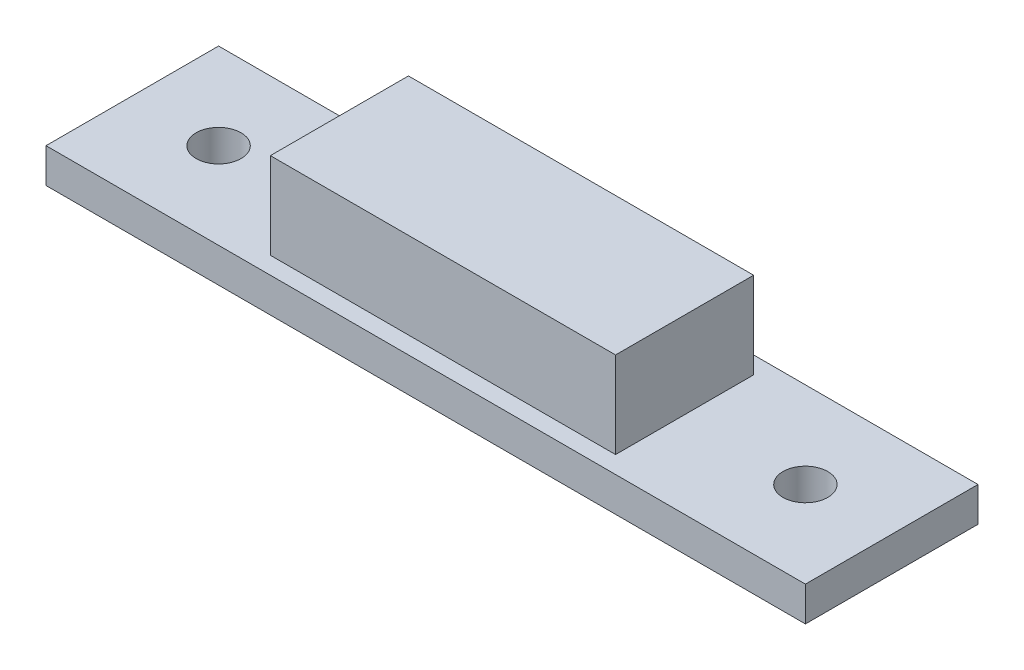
ISO-10303-21;
HEADER;
FILE_DESCRIPTION(('STEP AP214'),'2;1');
FILE_NAME('part.step','',(''),(''),'','','');
FILE_SCHEMA(('AUTOMOTIVE_DESIGN { 1 0 10303 214 1 1 1 1 }'));
ENDSEC;
DATA;
#1=APPLICATION_CONTEXT('core data for automotive mechanical design processes');
#2=APPLICATION_PROTOCOL_DEFINITION('international standard','automotive_design',2000,#1);
#3=PRODUCT_CONTEXT('',#1,'mechanical');
#4=PRODUCT('Part','Part','',(#3));
#5=PRODUCT_RELATED_PRODUCT_CATEGORY('part','',(#4));
#6=PRODUCT_DEFINITION_FORMATION('','',#4);
#7=PRODUCT_DEFINITION_CONTEXT('part definition',#1,'design');
#8=PRODUCT_DEFINITION('design','',#6,#7);
#9=PRODUCT_DEFINITION_SHAPE('','',#8);
#10=(LENGTH_UNIT() NAMED_UNIT(*) SI_UNIT(.MILLI.,.METRE.));
#11=(NAMED_UNIT(*) PLANE_ANGLE_UNIT() SI_UNIT($,.RADIAN.));
#12=(NAMED_UNIT(*) SI_UNIT($,.STERADIAN.) SOLID_ANGLE_UNIT());
#13=UNCERTAINTY_MEASURE_WITH_UNIT(LENGTH_MEASURE(1.E-05),#10,'distance_accuracy_value','');
#14=(GEOMETRIC_REPRESENTATION_CONTEXT(3) GLOBAL_UNCERTAINTY_ASSIGNED_CONTEXT((#13)) GLOBAL_UNIT_ASSIGNED_CONTEXT((#10,
#11,#12)) REPRESENTATION_CONTEXT('',''));
#15=CARTESIAN_POINT('',(0.,0.,0.));
#16=DIRECTION('',(0.,0.,1.));
#17=DIRECTION('',(1.,0.,0.));
#18=AXIS2_PLACEMENT_3D('',#15,#16,#17);
#19=CARTESIAN_POINT('',(-50.,35.,-20.));
#20=DIRECTION('',(1.,0.,0.));
#21=DIRECTION('',(0.,0.,-1.));
#22=AXIS2_PLACEMENT_3D('',#19,#20,#21);
#23=PLANE('',#22);
#24=DIRECTION('',(0.,0.,1.));
#25=VECTOR('',#24,1.);
#26=CARTESIAN_POINT('',(-50.,10.,-20.));
#27=LINE('',#26,#25);
#28=CARTESIAN_POINT('',(-50.,10.,-20.));
#29=VERTEX_POINT('',#28);
#30=CARTESIAN_POINT('',(-50.,10.,20.));
#31=VERTEX_POINT('',#30);
#32=EDGE_CURVE('E105',#29,#31,#27,.T.);
#33=ORIENTED_EDGE('',*,*,#32,.T.);
#34=DIRECTION('',(0.,-1.,0.));
#35=VECTOR('',#34,1.);
#36=CARTESIAN_POINT('',(-50.,35.,20.));
#37=LINE('',#36,#35);
#38=CARTESIAN_POINT('',(-50.,35.,20.));
#39=VERTEX_POINT('',#38);
#40=EDGE_CURVE('E12',#39,#31,#37,.T.);
#41=ORIENTED_EDGE('',*,*,#40,.F.);
#42=DIRECTION('',(0.,0.,1.));
#43=VECTOR('',#42,1.);
#44=CARTESIAN_POINT('',(-50.,35.,-20.));
#45=LINE('',#44,#43);
#46=CARTESIAN_POINT('',(-50.,35.,-20.));
#47=VERTEX_POINT('',#46);
#48=EDGE_CURVE('E93',#47,#39,#45,.T.);
#49=ORIENTED_EDGE('',*,*,#48,.F.);
#50=DIRECTION('',(0.,-1.,0.));
#51=VECTOR('',#50,1.);
#52=CARTESIAN_POINT('',(-50.,35.,-20.));
#53=LINE('',#52,#51);
#54=EDGE_CURVE('E101',#47,#29,#53,.T.);
#55=ORIENTED_EDGE('',*,*,#54,.T.);
#56=EDGE_LOOP('',(#33,#41,#49,#55));
#57=FACE_BOUND('',#56,.T.);
#58=ADVANCED_FACE('F42',(#57),#23,.F.);
#59=CARTESIAN_POINT('',(-50.,35.,20.));
#60=DIRECTION('',(0.,0.,-1.));
#61=DIRECTION('',(-1.,0.,0.));
#62=AXIS2_PLACEMENT_3D('',#59,#60,#61);
#63=PLANE('',#62);
#64=DIRECTION('',(1.,0.,0.));
#65=VECTOR('',#64,1.);
#66=CARTESIAN_POINT('',(-50.,10.,20.));
#67=LINE('',#66,#65);
#68=CARTESIAN_POINT('',(50.,10.,20.));
#69=VERTEX_POINT('',#68);
#70=EDGE_CURVE('E97',#31,#69,#67,.T.);
#71=ORIENTED_EDGE('',*,*,#70,.T.);
#72=DIRECTION('',(0.,-1.,0.));
#73=VECTOR('',#72,1.);
#74=CARTESIAN_POINT('',(50.,35.,20.));
#75=LINE('',#74,#73);
#76=CARTESIAN_POINT('',(50.,35.,20.));
#77=VERTEX_POINT('',#76);
#78=EDGE_CURVE('E50',#77,#69,#75,.T.);
#79=ORIENTED_EDGE('',*,*,#78,.F.);
#80=DIRECTION('',(1.,0.,0.));
#81=VECTOR('',#80,1.);
#82=CARTESIAN_POINT('',(-50.,35.,20.));
#83=LINE('',#82,#81);
#84=EDGE_CURVE('E88',#39,#77,#83,.T.);
#85=ORIENTED_EDGE('',*,*,#84,.F.);
#86=ORIENTED_EDGE('',*,*,#40,.T.);
#87=EDGE_LOOP('',(#71,#79,#85,#86));
#88=FACE_BOUND('',#87,.T.);
#89=ADVANCED_FACE('F96',(#88),#63,.F.);
#90=CARTESIAN_POINT('',(50.,35.,-20.));
#91=DIRECTION('',(-1.,0.,0.));
#92=DIRECTION('',(0.,0.,1.));
#93=AXIS2_PLACEMENT_3D('',#90,#91,#92);
#94=PLANE('',#93);
#95=DIRECTION('',(0.,0.,-1.));
#96=VECTOR('',#95,1.);
#97=CARTESIAN_POINT('',(50.,10.,-20.));
#98=LINE('',#97,#96);
#99=CARTESIAN_POINT('',(50.,10.,-20.));
#100=VERTEX_POINT('',#99);
#101=EDGE_CURVE('E75',#69,#100,#98,.T.);
#102=ORIENTED_EDGE('',*,*,#101,.T.);
#103=DIRECTION('',(0.,-1.,0.));
#104=VECTOR('',#103,1.);
#105=CARTESIAN_POINT('',(50.,35.,-20.));
#106=LINE('',#105,#104);
#107=CARTESIAN_POINT('',(50.,35.,-20.));
#108=VERTEX_POINT('',#107);
#109=EDGE_CURVE('E98',#108,#100,#106,.T.);
#110=ORIENTED_EDGE('',*,*,#109,.F.);
#111=DIRECTION('',(0.,0.,-1.));
#112=VECTOR('',#111,1.);
#113=CARTESIAN_POINT('',(50.,35.,-20.));
#114=LINE('',#113,#112);
#115=EDGE_CURVE('E91',#77,#108,#114,.T.);
#116=ORIENTED_EDGE('',*,*,#115,.F.);
#117=ORIENTED_EDGE('',*,*,#78,.T.);
#118=EDGE_LOOP('',(#102,#110,#116,#117));
#119=FACE_BOUND('',#118,.T.);
#120=ADVANCED_FACE('F99',(#119),#94,.F.);
#121=CARTESIAN_POINT('',(-50.,35.,-20.));
#122=DIRECTION('',(0.,0.,1.));
#123=DIRECTION('',(1.,0.,0.));
#124=AXIS2_PLACEMENT_3D('',#121,#122,#123);
#125=PLANE('',#124);
#126=DIRECTION('',(-1.,0.,0.));
#127=VECTOR('',#126,1.);
#128=CARTESIAN_POINT('',(-50.,10.,-20.));
#129=LINE('',#128,#127);
#130=EDGE_CURVE('E81',#100,#29,#129,.T.);
#131=ORIENTED_EDGE('',*,*,#130,.T.);
#132=ORIENTED_EDGE('',*,*,#54,.F.);
#133=DIRECTION('',(-1.,0.,0.));
#134=VECTOR('',#133,1.);
#135=CARTESIAN_POINT('',(-50.,35.,-20.));
#136=LINE('',#135,#134);
#137=EDGE_CURVE('E58',#108,#47,#136,.T.);
#138=ORIENTED_EDGE('',*,*,#137,.F.);
#139=ORIENTED_EDGE('',*,*,#109,.T.);
#140=EDGE_LOOP('',(#131,#132,#138,#139));
#141=FACE_BOUND('',#140,.T.);
#142=ADVANCED_FACE('F112',(#141),#125,.F.);
#143=CARTESIAN_POINT('',(-50.,35.,20.));
#144=DIRECTION('',(0.,1.,0.));
#145=DIRECTION('',(0.,0.,1.));
#146=AXIS2_PLACEMENT_3D('',#143,#144,#145);
#147=PLANE('',#146);
#148=ORIENTED_EDGE('',*,*,#48,.T.);
#149=ORIENTED_EDGE('',*,*,#84,.T.);
#150=ORIENTED_EDGE('',*,*,#115,.T.);
#151=ORIENTED_EDGE('',*,*,#137,.T.);
#152=EDGE_LOOP('',(#148,#149,#150,#151));
#153=FACE_BOUND('',#152,.T.);
#154=ADVANCED_FACE('F89',(#153),#147,.T.);
#155=CARTESIAN_POINT('',(-50.,10.,20.));
#156=DIRECTION('',(0.,1.,0.));
#157=DIRECTION('',(0.,0.,1.));
#158=AXIS2_PLACEMENT_3D('',#155,#156,#157);
#159=PLANE('',#158);
#160=ORIENTED_EDGE('',*,*,#32,.F.);
#161=ORIENTED_EDGE('',*,*,#130,.F.);
#162=ORIENTED_EDGE('',*,*,#101,.F.);
#163=ORIENTED_EDGE('',*,*,#70,.F.);
#164=EDGE_LOOP('',(#160,#161,#162,#163));
#165=FACE_BOUND('',#164,.T.);
#166=ADVANCED_FACE('F115',(#165),#159,.F.);
#167=CLOSED_SHELL('',(#58,#89,#120,#142,#154,#166));
#168=MANIFOLD_SOLID_BREP('B2',#167);
#169=CARTESIAN_POINT('',(-110.,10.,-25.));
#170=DIRECTION('',(1.,0.,0.));
#171=DIRECTION('',(0.,0.,-1.));
#172=AXIS2_PLACEMENT_3D('',#169,#170,#171);
#173=PLANE('',#172);
#174=DIRECTION('',(0.,0.,1.));
#175=VECTOR('',#174,1.);
#176=CARTESIAN_POINT('',(-110.,0.,-25.));
#177=LINE('',#176,#175);
#178=CARTESIAN_POINT('',(-110.,0.,-25.));
#179=VERTEX_POINT('',#178);
#180=CARTESIAN_POINT('',(-110.,0.,25.));
#181=VERTEX_POINT('',#180);
#182=EDGE_CURVE('E231',#179,#181,#177,.T.);
#183=ORIENTED_EDGE('',*,*,#182,.T.);
#184=DIRECTION('',(0.,-1.,0.));
#185=VECTOR('',#184,1.);
#186=CARTESIAN_POINT('',(-110.,10.,25.));
#187=LINE('',#186,#185);
#188=CARTESIAN_POINT('',(-110.,10.,25.));
#189=VERTEX_POINT('',#188);
#190=EDGE_CURVE('E40',#189,#181,#187,.T.);
#191=ORIENTED_EDGE('',*,*,#190,.F.);
#192=DIRECTION('',(0.,0.,1.));
#193=VECTOR('',#192,1.);
#194=CARTESIAN_POINT('',(-110.,10.,-25.));
#195=LINE('',#194,#193);
#196=CARTESIAN_POINT('',(-110.,10.,-25.));
#197=VERTEX_POINT('',#196);
#198=EDGE_CURVE('E218',#197,#189,#195,.T.);
#199=ORIENTED_EDGE('',*,*,#198,.F.);
#200=DIRECTION('',(0.,-1.,0.));
#201=VECTOR('',#200,1.);
#202=CARTESIAN_POINT('',(-110.,10.,-25.));
#203=LINE('',#202,#201);
#204=EDGE_CURVE('E227',#197,#179,#203,.T.);
#205=ORIENTED_EDGE('',*,*,#204,.T.);
#206=EDGE_LOOP('',(#183,#191,#199,#205));
#207=FACE_BOUND('',#206,.T.);
#208=ADVANCED_FACE('F165',(#207),#173,.F.);
#209=CARTESIAN_POINT('',(-110.,10.,25.));
#210=DIRECTION('',(0.,0.,-1.));
#211=DIRECTION('',(-1.,0.,0.));
#212=AXIS2_PLACEMENT_3D('',#209,#210,#211);
#213=PLANE('',#212);
#214=DIRECTION('',(1.,0.,0.));
#215=VECTOR('',#214,1.);
#216=CARTESIAN_POINT('',(-110.,0.,25.));
#217=LINE('',#216,#215);
#218=CARTESIAN_POINT('',(110.,0.,25.));
#219=VERTEX_POINT('',#218);
#220=EDGE_CURVE('E222',#181,#219,#217,.T.);
#221=ORIENTED_EDGE('',*,*,#220,.T.);
#222=DIRECTION('',(0.,-1.,0.));
#223=VECTOR('',#222,1.);
#224=CARTESIAN_POINT('',(110.,10.,25.));
#225=LINE('',#224,#223);
#226=CARTESIAN_POINT('',(110.,10.,25.));
#227=VERTEX_POINT('',#226);
#228=EDGE_CURVE('E174',#227,#219,#225,.T.);
#229=ORIENTED_EDGE('',*,*,#228,.F.);
#230=DIRECTION('',(1.,0.,0.));
#231=VECTOR('',#230,1.);
#232=CARTESIAN_POINT('',(-110.,10.,25.));
#233=LINE('',#232,#231);
#234=EDGE_CURVE('E213',#189,#227,#233,.T.);
#235=ORIENTED_EDGE('',*,*,#234,.F.);
#236=ORIENTED_EDGE('',*,*,#190,.T.);
#237=EDGE_LOOP('',(#221,#229,#235,#236));
#238=FACE_BOUND('',#237,.T.);
#239=ADVANCED_FACE('F221',(#238),#213,.F.);
#240=CARTESIAN_POINT('',(110.,10.,-25.));
#241=DIRECTION('',(-1.,0.,0.));
#242=DIRECTION('',(0.,0.,1.));
#243=AXIS2_PLACEMENT_3D('',#240,#241,#242);
#244=PLANE('',#243);
#245=DIRECTION('',(0.,0.,-1.));
#246=VECTOR('',#245,1.);
#247=CARTESIAN_POINT('',(110.,0.,-25.));
#248=LINE('',#247,#246);
#249=CARTESIAN_POINT('',(110.,0.,-25.));
#250=VERTEX_POINT('',#249);
#251=EDGE_CURVE('E200',#219,#250,#248,.T.);
#252=ORIENTED_EDGE('',*,*,#251,.T.);
#253=DIRECTION('',(0.,-1.,0.));
#254=VECTOR('',#253,1.);
#255=CARTESIAN_POINT('',(110.,10.,-25.));
#256=LINE('',#255,#254);
#257=CARTESIAN_POINT('',(110.,10.,-25.));
#258=VERTEX_POINT('',#257);
#259=EDGE_CURVE('E223',#258,#250,#256,.T.);
#260=ORIENTED_EDGE('',*,*,#259,.F.);
#261=DIRECTION('',(0.,0.,-1.));
#262=VECTOR('',#261,1.);
#263=CARTESIAN_POINT('',(110.,10.,-25.));
#264=LINE('',#263,#262);
#265=EDGE_CURVE('E216',#227,#258,#264,.T.);
#266=ORIENTED_EDGE('',*,*,#265,.F.);
#267=ORIENTED_EDGE('',*,*,#228,.T.);
#268=EDGE_LOOP('',(#252,#260,#266,#267));
#269=FACE_BOUND('',#268,.T.);
#270=ADVANCED_FACE('F225',(#269),#244,.F.);
#271=CARTESIAN_POINT('',(-110.,10.,-25.));
#272=DIRECTION('',(0.,0.,1.));
#273=DIRECTION('',(1.,0.,0.));
#274=AXIS2_PLACEMENT_3D('',#271,#272,#273);
#275=PLANE('',#274);
#276=DIRECTION('',(-1.,0.,0.));
#277=VECTOR('',#276,1.);
#278=CARTESIAN_POINT('',(-110.,0.,-25.));
#279=LINE('',#278,#277);
#280=EDGE_CURVE('E206',#250,#179,#279,.T.);
#281=ORIENTED_EDGE('',*,*,#280,.T.);
#282=ORIENTED_EDGE('',*,*,#204,.F.);
#283=DIRECTION('',(-1.,0.,0.));
#284=VECTOR('',#283,1.);
#285=CARTESIAN_POINT('',(-110.,10.,-25.));
#286=LINE('',#285,#284);
#287=EDGE_CURVE('E183',#258,#197,#286,.T.);
#288=ORIENTED_EDGE('',*,*,#287,.F.);
#289=ORIENTED_EDGE('',*,*,#259,.T.);
#290=EDGE_LOOP('',(#281,#282,#288,#289));
#291=FACE_BOUND('',#290,.T.);
#292=ADVANCED_FACE('F259',(#291),#275,.F.);
#293=CARTESIAN_POINT('',(-110.,10.,25.));
#294=DIRECTION('',(0.,1.,0.));
#295=DIRECTION('',(0.,0.,1.));
#296=AXIS2_PLACEMENT_3D('',#293,#294,#295);
#297=PLANE('',#296);
#298=CARTESIAN_POINT('',(85.,10.,0.));
#299=DIRECTION('',(0.,1.,0.));
#300=DIRECTION('',(0.,0.,1.));
#301=AXIS2_PLACEMENT_3D('',#298,#299,#300);
#302=CIRCLE('',#301,6.5);
#303=CARTESIAN_POINT('',(85.,10.,6.5));
#304=VERTEX_POINT('',#303);
#305=EDGE_CURVE('E248',#304,#304,#302,.T.);
#306=ORIENTED_EDGE('',*,*,#305,.F.);
#307=EDGE_LOOP('',(#306));
#308=FACE_BOUND('',#307,.T.);
#309=CARTESIAN_POINT('',(-85.,10.,0.));
#310=DIRECTION('',(0.,1.,0.));
#311=DIRECTION('',(0.,0.,1.));
#312=AXIS2_PLACEMENT_3D('',#309,#310,#311);
#313=CIRCLE('',#312,6.5);
#314=CARTESIAN_POINT('',(-85.,10.,6.5));
#315=VERTEX_POINT('',#314);
#316=EDGE_CURVE('E240',#315,#315,#313,.T.);
#317=ORIENTED_EDGE('',*,*,#316,.F.);
#318=EDGE_LOOP('',(#317));
#319=FACE_BOUND('',#318,.T.);
#320=ORIENTED_EDGE('',*,*,#198,.T.);
#321=ORIENTED_EDGE('',*,*,#234,.T.);
#322=ORIENTED_EDGE('',*,*,#265,.T.);
#323=ORIENTED_EDGE('',*,*,#287,.T.);
#324=EDGE_LOOP('',(#320,#321,#322,#323));
#325=FACE_BOUND('',#324,.T.);
#326=ADVANCED_FACE('F214',(#308,#319,#325),#297,.T.);
#327=CARTESIAN_POINT('',(-110.,0.,25.));
#328=DIRECTION('',(0.,1.,0.));
#329=DIRECTION('',(0.,0.,1.));
#330=AXIS2_PLACEMENT_3D('',#327,#328,#329);
#331=PLANE('',#330);
#332=CARTESIAN_POINT('',(85.,0.,0.));
#333=DIRECTION('',(0.,1.,0.));
#334=DIRECTION('',(0.,0.,1.));
#335=AXIS2_PLACEMENT_3D('',#332,#333,#334);
#336=CIRCLE('',#335,6.5);
#337=CARTESIAN_POINT('',(85.,0.,6.5));
#338=VERTEX_POINT('',#337);
#339=EDGE_CURVE('E168',#338,#338,#336,.T.);
#340=ORIENTED_EDGE('',*,*,#339,.T.);
#341=EDGE_LOOP('',(#340));
#342=FACE_BOUND('',#341,.T.);
#343=CARTESIAN_POINT('',(-85.,0.,0.));
#344=DIRECTION('',(0.,1.,0.));
#345=DIRECTION('',(0.,0.,1.));
#346=AXIS2_PLACEMENT_3D('',#343,#344,#345);
#347=CIRCLE('',#346,6.5);
#348=CARTESIAN_POINT('',(-85.,0.,6.5));
#349=VERTEX_POINT('',#348);
#350=EDGE_CURVE('E234',#349,#349,#347,.T.);
#351=ORIENTED_EDGE('',*,*,#350,.T.);
#352=EDGE_LOOP('',(#351));
#353=FACE_BOUND('',#352,.T.);
#354=ORIENTED_EDGE('',*,*,#182,.F.);
#355=ORIENTED_EDGE('',*,*,#280,.F.);
#356=ORIENTED_EDGE('',*,*,#251,.F.);
#357=ORIENTED_EDGE('',*,*,#220,.F.);
#358=EDGE_LOOP('',(#354,#355,#356,#357));
#359=FACE_BOUND('',#358,.T.);
#360=ADVANCED_FACE('F258',(#342,#353,#359),#331,.F.);
#361=CARTESIAN_POINT('',(-85.,-15.,0.));
#362=DIRECTION('',(0.,1.,0.));
#363=DIRECTION('',(0.,0.,1.));
#364=AXIS2_PLACEMENT_3D('',#361,#362,#363);
#365=CYLINDRICAL_SURFACE('',#364,6.5);
#366=ORIENTED_EDGE('',*,*,#316,.T.);
#367=EDGE_LOOP('',(#366));
#368=FACE_BOUND('',#367,.T.);
#369=ORIENTED_EDGE('',*,*,#350,.F.);
#370=EDGE_LOOP('',(#369));
#371=FACE_BOUND('',#370,.T.);
#372=ADVANCED_FACE('F265',(#368,#371),#365,.F.);
#373=CARTESIAN_POINT('',(85.,-15.,0.));
#374=DIRECTION('',(0.,1.,0.));
#375=DIRECTION('',(0.,0.,1.));
#376=AXIS2_PLACEMENT_3D('',#373,#374,#375);
#377=CYLINDRICAL_SURFACE('',#376,6.5);
#378=ORIENTED_EDGE('',*,*,#305,.T.);
#379=EDGE_LOOP('',(#378));
#380=FACE_BOUND('',#379,.T.);
#381=ORIENTED_EDGE('',*,*,#339,.F.);
#382=EDGE_LOOP('',(#381));
#383=FACE_BOUND('',#382,.T.);
#384=ADVANCED_FACE('F253',(#380,#383),#377,.F.);
#385=CLOSED_SHELL('',(#208,#239,#270,#292,#326,#360,#372,#384));
#386=MANIFOLD_SOLID_BREP('B6',#385);
#387=ADVANCED_BREP_SHAPE_REPRESENTATION('',(#18,#168,#386),#14);
#388=SHAPE_DEFINITION_REPRESENTATION(#9,#387);
ENDSEC;
END-ISO-10303-21;
